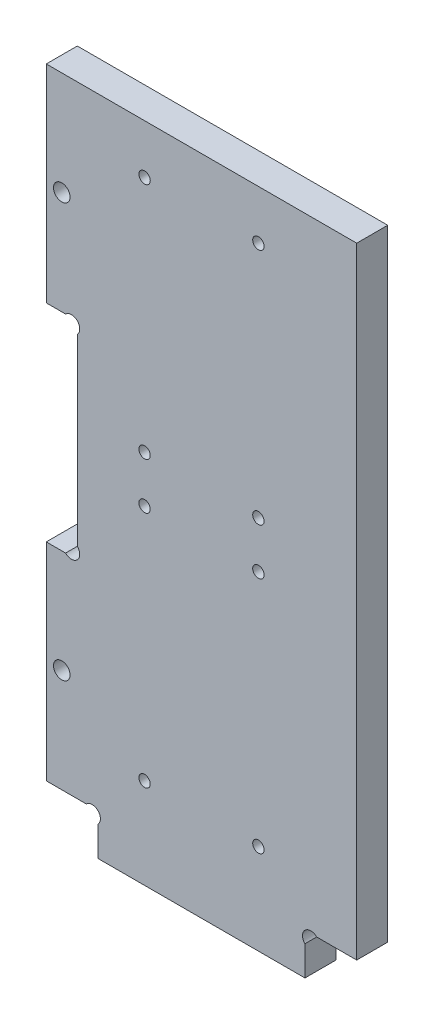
ISO-10303-21;
HEADER;
FILE_DESCRIPTION(('STEP AP214'),'2;1');
FILE_NAME('part.step','',(''),(''),'','','');
FILE_SCHEMA(('AUTOMOTIVE_DESIGN { 1 0 10303 214 1 1 1 1 }'));
ENDSEC;
DATA;
#1=APPLICATION_CONTEXT('core data for automotive mechanical design processes');
#2=APPLICATION_PROTOCOL_DEFINITION('international standard','automotive_design',2000,#1);
#3=PRODUCT_CONTEXT('',#1,'mechanical');
#4=PRODUCT('Part','Part','',(#3));
#5=PRODUCT_RELATED_PRODUCT_CATEGORY('part','',(#4));
#6=PRODUCT_DEFINITION_FORMATION('','',#4);
#7=PRODUCT_DEFINITION_CONTEXT('part definition',#1,'design');
#8=PRODUCT_DEFINITION('design','',#6,#7);
#9=PRODUCT_DEFINITION_SHAPE('','',#8);
#10=(LENGTH_UNIT() NAMED_UNIT(*) SI_UNIT(.MILLI.,.METRE.));
#11=(NAMED_UNIT(*) PLANE_ANGLE_UNIT() SI_UNIT($,.RADIAN.));
#12=(NAMED_UNIT(*) SI_UNIT($,.STERADIAN.) SOLID_ANGLE_UNIT());
#13=UNCERTAINTY_MEASURE_WITH_UNIT(LENGTH_MEASURE(1.E-05),#10,'distance_accuracy_value','');
#14=(GEOMETRIC_REPRESENTATION_CONTEXT(3) GLOBAL_UNCERTAINTY_ASSIGNED_CONTEXT((#13)) GLOBAL_UNIT_ASSIGNED_CONTEXT((#10,
#11,#12)) REPRESENTATION_CONTEXT('',''));
#15=CARTESIAN_POINT('',(0.,0.,0.));
#16=DIRECTION('',(0.,0.,1.));
#17=DIRECTION('',(1.,0.,0.));
#18=AXIS2_PLACEMENT_3D('',#15,#16,#17);
#19=CARTESIAN_POINT('',(51.1313708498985,8.86862915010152,6.));
#20=DIRECTION('',(0.,0.,-1.));
#21=DIRECTION('',(-1.,0.,0.));
#22=AXIS2_PLACEMENT_3D('',#19,#20,#21);
#23=PLANE('',#22);
#24=CARTESIAN_POINT('',(3.,110.,6.));
#25=DIRECTION('',(0.,0.,1.));
#26=DIRECTION('',(1.,0.,0.));
#27=AXIS2_PLACEMENT_3D('',#24,#25,#26);
#28=CIRCLE('',#27,1.6);
#29=CARTESIAN_POINT('',(4.6,110.,6.));
#30=VERTEX_POINT('',#29);
#31=EDGE_CURVE('E356',#30,#30,#28,.T.);
#32=ORIENTED_EDGE('',*,*,#31,.F.);
#33=EDGE_LOOP('',(#32));
#34=FACE_BOUND('',#33,.T.);
#35=CARTESIAN_POINT('',(41.,19.5,6.));
#36=DIRECTION('',(0.,0.,1.));
#37=DIRECTION('',(1.,0.,0.));
#38=AXIS2_PLACEMENT_3D('',#35,#36,#37);
#39=CIRCLE('',#38,1.1);
#40=CARTESIAN_POINT('',(42.1,19.5,6.));
#41=VERTEX_POINT('',#40);
#42=EDGE_CURVE('E368',#41,#41,#39,.T.);
#43=ORIENTED_EDGE('',*,*,#42,.F.);
#44=EDGE_LOOP('',(#43));
#45=FACE_BOUND('',#44,.T.);
#46=CARTESIAN_POINT('',(19.,65.5,6.));
#47=DIRECTION('',(0.,0.,1.));
#48=DIRECTION('',(-1.,0.,0.));
#49=AXIS2_PLACEMENT_3D('',#46,#47,#48);
#50=CIRCLE('',#49,1.1);
#51=CARTESIAN_POINT('',(17.9,65.5,6.));
#52=VERTEX_POINT('',#51);
#53=EDGE_CURVE('E380',#52,#52,#50,.T.);
#54=ORIENTED_EDGE('',*,*,#53,.F.);
#55=EDGE_LOOP('',(#54));
#56=FACE_BOUND('',#55,.T.);
#57=CARTESIAN_POINT('',(41.,74.5,6.));
#58=DIRECTION('',(0.,0.,1.));
#59=DIRECTION('',(-1.,0.,0.));
#60=AXIS2_PLACEMENT_3D('',#57,#58,#59);
#61=CIRCLE('',#60,1.09999999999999);
#62=CARTESIAN_POINT('',(39.9,74.5,6.));
#63=VERTEX_POINT('',#62);
#64=EDGE_CURVE('E392',#63,#63,#61,.T.);
#65=ORIENTED_EDGE('',*,*,#64,.F.);
#66=EDGE_LOOP('',(#65));
#67=FACE_BOUND('',#66,.T.);
#68=CARTESIAN_POINT('',(19.,120.5,6.));
#69=DIRECTION('',(0.,0.,1.));
#70=DIRECTION('',(1.,0.,0.));
#71=AXIS2_PLACEMENT_3D('',#68,#69,#70);
#72=CIRCLE('',#71,1.1);
#73=CARTESIAN_POINT('',(20.1,120.5,6.));
#74=VERTEX_POINT('',#73);
#75=EDGE_CURVE('E166',#74,#74,#72,.T.);
#76=ORIENTED_EDGE('',*,*,#75,.F.);
#77=EDGE_LOOP('',(#76));
#78=FACE_BOUND('',#77,.T.);
#79=CARTESIAN_POINT('',(51.1313708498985,8.86862915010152,6.));
#80=DIRECTION('',(0.,0.,-1.));
#81=DIRECTION('',(-1.,0.,0.));
#82=AXIS2_PLACEMENT_3D('',#79,#80,#81);
#83=CIRCLE('',#82,1.6);
#84=CARTESIAN_POINT('',(50.,7.73725830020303,6.));
#85=VERTEX_POINT('',#84);
#86=CARTESIAN_POINT('',(52.2627416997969,10.,6.));
#87=VERTEX_POINT('',#86);
#88=EDGE_CURVE('E193',#85,#87,#83,.T.);
#89=ORIENTED_EDGE('',*,*,#88,.T.);
#90=DIRECTION('',(1.,0.,0.));
#91=VECTOR('',#90,1.);
#92=CARTESIAN_POINT('',(52.2627416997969,10.,6.));
#93=LINE('',#92,#91);
#94=CARTESIAN_POINT('',(60.,10.,6.));
#95=VERTEX_POINT('',#94);
#96=EDGE_CURVE('E101',#87,#95,#93,.T.);
#97=ORIENTED_EDGE('',*,*,#96,.T.);
#98=DIRECTION('',(0.,1.,0.));
#99=VECTOR('',#98,1.);
#100=CARTESIAN_POINT('',(60.,10.,6.));
#101=LINE('',#100,#99);
#102=CARTESIAN_POINT('',(60.,130.,6.));
#103=VERTEX_POINT('',#102);
#104=EDGE_CURVE('E232',#95,#103,#101,.T.);
#105=ORIENTED_EDGE('',*,*,#104,.T.);
#106=DIRECTION('',(-1.,0.,0.));
#107=VECTOR('',#106,1.);
#108=CARTESIAN_POINT('',(0.,130.,6.));
#109=LINE('',#108,#107);
#110=CARTESIAN_POINT('',(0.,130.,6.));
#111=VERTEX_POINT('',#110);
#112=EDGE_CURVE('E251',#103,#111,#109,.T.);
#113=ORIENTED_EDGE('',*,*,#112,.T.);
#114=DIRECTION('',(0.,-1.,0.));
#115=VECTOR('',#114,1.);
#116=CARTESIAN_POINT('',(0.,90.,6.));
#117=LINE('',#116,#115);
#118=CARTESIAN_POINT('',(0.,90.,6.));
#119=VERTEX_POINT('',#118);
#120=EDGE_CURVE('E248',#111,#119,#117,.T.);
#121=ORIENTED_EDGE('',*,*,#120,.T.);
#122=DIRECTION('',(1.,0.,0.));
#123=VECTOR('',#122,1.);
#124=CARTESIAN_POINT('',(3.73725830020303,90.,6.));
#125=LINE('',#124,#123);
#126=CARTESIAN_POINT('',(3.73725830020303,90.,6.));
#127=VERTEX_POINT('',#126);
#128=EDGE_CURVE('E250',#119,#127,#125,.T.);
#129=ORIENTED_EDGE('',*,*,#128,.T.);
#130=CARTESIAN_POINT('',(4.86862915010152,88.8686291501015,6.));
#131=DIRECTION('',(0.,0.,-1.));
#132=DIRECTION('',(1.,0.,0.));
#133=AXIS2_PLACEMENT_3D('',#130,#131,#132);
#134=CIRCLE('',#133,1.59999999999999);
#135=CARTESIAN_POINT('',(6.00000000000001,87.7372583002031,6.));
#136=VERTEX_POINT('',#135);
#137=EDGE_CURVE('E253',#127,#136,#134,.T.);
#138=ORIENTED_EDGE('',*,*,#137,.T.);
#139=DIRECTION('',(0.,-1.,0.));
#140=VECTOR('',#139,1.);
#141=CARTESIAN_POINT('',(6.00000000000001,87.7372583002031,6.));
#142=LINE('',#141,#140);
#143=CARTESIAN_POINT('',(6.00000000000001,52.2627416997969,6.));
#144=VERTEX_POINT('',#143);
#145=EDGE_CURVE('E259',#136,#144,#142,.T.);
#146=ORIENTED_EDGE('',*,*,#145,.T.);
#147=CARTESIAN_POINT('',(4.86862915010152,51.1313708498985,6.));
#148=DIRECTION('',(0.,0.,-1.));
#149=DIRECTION('',(-1.,0.,0.));
#150=AXIS2_PLACEMENT_3D('',#147,#148,#149);
#151=CIRCLE('',#150,1.59999999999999);
#152=CARTESIAN_POINT('',(3.73725830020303,50.,6.));
#153=VERTEX_POINT('',#152);
#154=EDGE_CURVE('E261',#144,#153,#151,.T.);
#155=ORIENTED_EDGE('',*,*,#154,.T.);
#156=DIRECTION('',(-1.,0.,0.));
#157=VECTOR('',#156,1.);
#158=CARTESIAN_POINT('',(3.73725830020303,50.,6.));
#159=LINE('',#158,#157);
#160=CARTESIAN_POINT('',(0.,50.,6.));
#161=VERTEX_POINT('',#160);
#162=EDGE_CURVE('E263',#153,#161,#159,.T.);
#163=ORIENTED_EDGE('',*,*,#162,.T.);
#164=DIRECTION('',(0.,-1.,0.));
#165=VECTOR('',#164,1.);
#166=CARTESIAN_POINT('',(0.,10.,6.));
#167=LINE('',#166,#165);
#168=CARTESIAN_POINT('',(0.,10.,6.));
#169=VERTEX_POINT('',#168);
#170=EDGE_CURVE('E265',#161,#169,#167,.T.);
#171=ORIENTED_EDGE('',*,*,#170,.T.);
#172=DIRECTION('',(1.,0.,0.));
#173=VECTOR('',#172,1.);
#174=CARTESIAN_POINT('',(7.73725830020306,10.,6.));
#175=LINE('',#174,#173);
#176=CARTESIAN_POINT('',(7.73725830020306,10.,6.));
#177=VERTEX_POINT('',#176);
#178=EDGE_CURVE('E267',#169,#177,#175,.T.);
#179=ORIENTED_EDGE('',*,*,#178,.T.);
#180=CARTESIAN_POINT('',(8.86862915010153,8.86862915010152,6.));
#181=DIRECTION('',(0.,0.,-1.));
#182=DIRECTION('',(1.,0.,0.));
#183=AXIS2_PLACEMENT_3D('',#180,#181,#182);
#184=CIRCLE('',#183,1.6);
#185=CARTESIAN_POINT('',(10.,7.73725830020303,6.));
#186=VERTEX_POINT('',#185);
#187=EDGE_CURVE('E144',#177,#186,#184,.T.);
#188=ORIENTED_EDGE('',*,*,#187,.T.);
#189=DIRECTION('',(0.,-1.,0.));
#190=VECTOR('',#189,1.);
#191=CARTESIAN_POINT('',(10.,7.73725830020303,6.));
#192=LINE('',#191,#190);
#193=CARTESIAN_POINT('',(10.,2.,6.));
#194=VERTEX_POINT('',#193);
#195=EDGE_CURVE('E138',#186,#194,#192,.T.);
#196=ORIENTED_EDGE('',*,*,#195,.T.);
#197=DIRECTION('',(1.,0.,0.));
#198=VECTOR('',#197,1.);
#199=CARTESIAN_POINT('',(10.,2.,6.));
#200=LINE('',#199,#198);
#201=CARTESIAN_POINT('',(50.,2.,6.));
#202=VERTEX_POINT('',#201);
#203=EDGE_CURVE('E142',#194,#202,#200,.T.);
#204=ORIENTED_EDGE('',*,*,#203,.T.);
#205=DIRECTION('',(0.,1.,0.));
#206=VECTOR('',#205,1.);
#207=CARTESIAN_POINT('',(50.,7.73725830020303,6.));
#208=LINE('',#207,#206);
#209=EDGE_CURVE('E34',#202,#85,#208,.T.);
#210=ORIENTED_EDGE('',*,*,#209,.T.);
#211=EDGE_LOOP('',(#89,#97,#105,#113,#121,#129,#138,#146,#155,#163,#171,#179,#188,#196,#204,#210));
#212=FACE_BOUND('',#211,.T.);
#213=CARTESIAN_POINT('',(19.,74.5,6.));
#214=DIRECTION('',(0.,0.,1.));
#215=DIRECTION('',(1.,0.,0.));
#216=AXIS2_PLACEMENT_3D('',#213,#214,#215);
#217=CIRCLE('',#216,1.1);
#218=CARTESIAN_POINT('',(20.1,74.5,6.));
#219=VERTEX_POINT('',#218);
#220=EDGE_CURVE('E398',#219,#219,#217,.T.);
#221=ORIENTED_EDGE('',*,*,#220,.F.);
#222=EDGE_LOOP('',(#221));
#223=FACE_BOUND('',#222,.T.);
#224=CARTESIAN_POINT('',(41.,120.5,6.));
#225=DIRECTION('',(0.,0.,1.));
#226=DIRECTION('',(-1.,0.,0.));
#227=AXIS2_PLACEMENT_3D('',#224,#225,#226);
#228=CIRCLE('',#227,1.1);
#229=CARTESIAN_POINT('',(39.9,120.5,6.));
#230=VERTEX_POINT('',#229);
#231=EDGE_CURVE('E386',#230,#230,#228,.T.);
#232=ORIENTED_EDGE('',*,*,#231,.F.);
#233=EDGE_LOOP('',(#232));
#234=FACE_BOUND('',#233,.T.);
#235=CARTESIAN_POINT('',(41.,65.5,6.));
#236=DIRECTION('',(0.,0.,1.));
#237=DIRECTION('',(1.,0.,0.));
#238=AXIS2_PLACEMENT_3D('',#235,#236,#237);
#239=CIRCLE('',#238,1.09999999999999);
#240=CARTESIAN_POINT('',(42.1,65.5,6.));
#241=VERTEX_POINT('',#240);
#242=EDGE_CURVE('E374',#241,#241,#239,.T.);
#243=ORIENTED_EDGE('',*,*,#242,.F.);
#244=EDGE_LOOP('',(#243));
#245=FACE_BOUND('',#244,.T.);
#246=CARTESIAN_POINT('',(19.,19.5,6.));
#247=DIRECTION('',(0.,0.,1.));
#248=DIRECTION('',(-1.,0.,0.));
#249=AXIS2_PLACEMENT_3D('',#246,#247,#248);
#250=CIRCLE('',#249,1.1);
#251=CARTESIAN_POINT('',(17.9,19.5,6.));
#252=VERTEX_POINT('',#251);
#253=EDGE_CURVE('E362',#252,#252,#250,.T.);
#254=ORIENTED_EDGE('',*,*,#253,.F.);
#255=EDGE_LOOP('',(#254));
#256=FACE_BOUND('',#255,.T.);
#257=CARTESIAN_POINT('',(3.,30.,6.));
#258=DIRECTION('',(0.,0.,1.));
#259=DIRECTION('',(-1.,0.,0.));
#260=AXIS2_PLACEMENT_3D('',#257,#258,#259);
#261=CIRCLE('',#260,1.6);
#262=CARTESIAN_POINT('',(1.4,30.,6.));
#263=VERTEX_POINT('',#262);
#264=EDGE_CURVE('E347',#263,#263,#261,.T.);
#265=ORIENTED_EDGE('',*,*,#264,.F.);
#266=EDGE_LOOP('',(#265));
#267=FACE_BOUND('',#266,.T.);
#268=ADVANCED_FACE('F17',(#34,#45,#56,#67,#78,#212,#223,#234,#245,#256,#267),#23,.F.);
#269=CARTESIAN_POINT('',(51.1313708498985,8.86862915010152,0.));
#270=DIRECTION('',(0.,0.,-1.));
#271=DIRECTION('',(-1.,0.,0.));
#272=AXIS2_PLACEMENT_3D('',#269,#270,#271);
#273=PLANE('',#272);
#274=CARTESIAN_POINT('',(3.,110.,0.));
#275=DIRECTION('',(0.,0.,1.));
#276=DIRECTION('',(1.,0.,0.));
#277=AXIS2_PLACEMENT_3D('',#274,#275,#276);
#278=CIRCLE('',#277,1.6);
#279=CARTESIAN_POINT('',(4.6,110.,0.));
#280=VERTEX_POINT('',#279);
#281=EDGE_CURVE('E353',#280,#280,#278,.T.);
#282=ORIENTED_EDGE('',*,*,#281,.T.);
#283=EDGE_LOOP('',(#282));
#284=FACE_BOUND('',#283,.T.);
#285=CARTESIAN_POINT('',(41.,19.5,0.));
#286=DIRECTION('',(0.,0.,1.));
#287=DIRECTION('',(1.,0.,0.));
#288=AXIS2_PLACEMENT_3D('',#285,#286,#287);
#289=CIRCLE('',#288,1.1);
#290=CARTESIAN_POINT('',(42.1,19.5,0.));
#291=VERTEX_POINT('',#290);
#292=EDGE_CURVE('E365',#291,#291,#289,.T.);
#293=ORIENTED_EDGE('',*,*,#292,.T.);
#294=EDGE_LOOP('',(#293));
#295=FACE_BOUND('',#294,.T.);
#296=CARTESIAN_POINT('',(19.,65.5,0.));
#297=DIRECTION('',(0.,0.,1.));
#298=DIRECTION('',(-1.,0.,0.));
#299=AXIS2_PLACEMENT_3D('',#296,#297,#298);
#300=CIRCLE('',#299,1.1);
#301=CARTESIAN_POINT('',(17.9,65.5,0.));
#302=VERTEX_POINT('',#301);
#303=EDGE_CURVE('E377',#302,#302,#300,.T.);
#304=ORIENTED_EDGE('',*,*,#303,.T.);
#305=EDGE_LOOP('',(#304));
#306=FACE_BOUND('',#305,.T.);
#307=CARTESIAN_POINT('',(41.,74.5,0.));
#308=DIRECTION('',(0.,0.,1.));
#309=DIRECTION('',(-1.,0.,0.));
#310=AXIS2_PLACEMENT_3D('',#307,#308,#309);
#311=CIRCLE('',#310,1.09999999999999);
#312=CARTESIAN_POINT('',(39.9,74.5,0.));
#313=VERTEX_POINT('',#312);
#314=EDGE_CURVE('E389',#313,#313,#311,.T.);
#315=ORIENTED_EDGE('',*,*,#314,.T.);
#316=EDGE_LOOP('',(#315));
#317=FACE_BOUND('',#316,.T.);
#318=CARTESIAN_POINT('',(19.,120.5,0.));
#319=DIRECTION('',(0.,0.,1.));
#320=DIRECTION('',(1.,0.,0.));
#321=AXIS2_PLACEMENT_3D('',#318,#319,#320);
#322=CIRCLE('',#321,1.1);
#323=CARTESIAN_POINT('',(20.1,120.5,0.));
#324=VERTEX_POINT('',#323);
#325=EDGE_CURVE('E401',#324,#324,#322,.T.);
#326=ORIENTED_EDGE('',*,*,#325,.T.);
#327=EDGE_LOOP('',(#326));
#328=FACE_BOUND('',#327,.T.);
#329=CARTESIAN_POINT('',(51.1313708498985,8.86862915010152,0.));
#330=DIRECTION('',(0.,0.,-1.));
#331=DIRECTION('',(-1.,0.,0.));
#332=AXIS2_PLACEMENT_3D('',#329,#330,#331);
#333=CIRCLE('',#332,1.6);
#334=CARTESIAN_POINT('',(50.,7.73725830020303,0.));
#335=VERTEX_POINT('',#334);
#336=CARTESIAN_POINT('',(52.2627416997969,10.,0.));
#337=VERTEX_POINT('',#336);
#338=EDGE_CURVE('E162',#335,#337,#333,.T.);
#339=ORIENTED_EDGE('',*,*,#338,.F.);
#340=DIRECTION('',(0.,1.,0.));
#341=VECTOR('',#340,1.);
#342=CARTESIAN_POINT('',(50.,7.73725830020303,0.));
#343=LINE('',#342,#341);
#344=CARTESIAN_POINT('',(50.,2.,0.));
#345=VERTEX_POINT('',#344);
#346=EDGE_CURVE('E93',#345,#335,#343,.T.);
#347=ORIENTED_EDGE('',*,*,#346,.F.);
#348=DIRECTION('',(1.,0.,0.));
#349=VECTOR('',#348,1.);
#350=CARTESIAN_POINT('',(10.,2.,0.));
#351=LINE('',#350,#349);
#352=CARTESIAN_POINT('',(10.,2.,0.));
#353=VERTEX_POINT('',#352);
#354=EDGE_CURVE('E87',#353,#345,#351,.T.);
#355=ORIENTED_EDGE('',*,*,#354,.F.);
#356=DIRECTION('',(0.,-1.,0.));
#357=VECTOR('',#356,1.);
#358=CARTESIAN_POINT('',(10.,7.73725830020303,0.));
#359=LINE('',#358,#357);
#360=CARTESIAN_POINT('',(10.,7.73725830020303,0.));
#361=VERTEX_POINT('',#360);
#362=EDGE_CURVE('E152',#361,#353,#359,.T.);
#363=ORIENTED_EDGE('',*,*,#362,.F.);
#364=CARTESIAN_POINT('',(8.86862915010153,8.86862915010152,0.));
#365=DIRECTION('',(0.,0.,-1.));
#366=DIRECTION('',(1.,0.,0.));
#367=AXIS2_PLACEMENT_3D('',#364,#365,#366);
#368=CIRCLE('',#367,1.6);
#369=CARTESIAN_POINT('',(7.73725830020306,10.,0.));
#370=VERTEX_POINT('',#369);
#371=EDGE_CURVE('E188',#370,#361,#368,.T.);
#372=ORIENTED_EDGE('',*,*,#371,.F.);
#373=DIRECTION('',(1.,0.,0.));
#374=VECTOR('',#373,1.);
#375=CARTESIAN_POINT('',(7.73725830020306,10.,0.));
#376=LINE('',#375,#374);
#377=CARTESIAN_POINT('',(0.,10.,0.));
#378=VERTEX_POINT('',#377);
#379=EDGE_CURVE('E186',#378,#370,#376,.T.);
#380=ORIENTED_EDGE('',*,*,#379,.F.);
#381=DIRECTION('',(0.,-1.,0.));
#382=VECTOR('',#381,1.);
#383=CARTESIAN_POINT('',(0.,10.,0.));
#384=LINE('',#383,#382);
#385=CARTESIAN_POINT('',(0.,50.,0.));
#386=VERTEX_POINT('',#385);
#387=EDGE_CURVE('E184',#386,#378,#384,.T.);
#388=ORIENTED_EDGE('',*,*,#387,.F.);
#389=DIRECTION('',(-1.,0.,0.));
#390=VECTOR('',#389,1.);
#391=CARTESIAN_POINT('',(3.73725830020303,50.,0.));
#392=LINE('',#391,#390);
#393=CARTESIAN_POINT('',(3.73725830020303,50.,0.));
#394=VERTEX_POINT('',#393);
#395=EDGE_CURVE('E182',#394,#386,#392,.T.);
#396=ORIENTED_EDGE('',*,*,#395,.F.);
#397=CARTESIAN_POINT('',(4.86862915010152,51.1313708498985,0.));
#398=DIRECTION('',(0.,0.,-1.));
#399=DIRECTION('',(-1.,0.,0.));
#400=AXIS2_PLACEMENT_3D('',#397,#398,#399);
#401=CIRCLE('',#400,1.59999999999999);
#402=CARTESIAN_POINT('',(6.00000000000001,52.2627416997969,0.));
#403=VERTEX_POINT('',#402);
#404=EDGE_CURVE('E180',#403,#394,#401,.T.);
#405=ORIENTED_EDGE('',*,*,#404,.F.);
#406=DIRECTION('',(0.,-1.,0.));
#407=VECTOR('',#406,1.);
#408=CARTESIAN_POINT('',(6.00000000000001,87.7372583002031,0.));
#409=LINE('',#408,#407);
#410=CARTESIAN_POINT('',(6.00000000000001,87.7372583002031,0.));
#411=VERTEX_POINT('',#410);
#412=EDGE_CURVE('E178',#411,#403,#409,.T.);
#413=ORIENTED_EDGE('',*,*,#412,.F.);
#414=CARTESIAN_POINT('',(4.86862915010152,88.8686291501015,0.));
#415=DIRECTION('',(0.,0.,-1.));
#416=DIRECTION('',(1.,0.,0.));
#417=AXIS2_PLACEMENT_3D('',#414,#415,#416);
#418=CIRCLE('',#417,1.59999999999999);
#419=CARTESIAN_POINT('',(3.73725830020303,90.,0.));
#420=VERTEX_POINT('',#419);
#421=EDGE_CURVE('E176',#420,#411,#418,.T.);
#422=ORIENTED_EDGE('',*,*,#421,.F.);
#423=DIRECTION('',(1.,0.,0.));
#424=VECTOR('',#423,1.);
#425=CARTESIAN_POINT('',(3.73725830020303,90.,0.));
#426=LINE('',#425,#424);
#427=CARTESIAN_POINT('',(0.,90.,0.));
#428=VERTEX_POINT('',#427);
#429=EDGE_CURVE('E174',#428,#420,#426,.T.);
#430=ORIENTED_EDGE('',*,*,#429,.F.);
#431=DIRECTION('',(0.,-1.,0.));
#432=VECTOR('',#431,1.);
#433=CARTESIAN_POINT('',(0.,90.,0.));
#434=LINE('',#433,#432);
#435=CARTESIAN_POINT('',(0.,130.,0.));
#436=VERTEX_POINT('',#435);
#437=EDGE_CURVE('E172',#436,#428,#434,.T.);
#438=ORIENTED_EDGE('',*,*,#437,.F.);
#439=DIRECTION('',(-1.,0.,0.));
#440=VECTOR('',#439,1.);
#441=CARTESIAN_POINT('',(0.,130.,0.));
#442=LINE('',#441,#440);
#443=CARTESIAN_POINT('',(60.,130.,0.));
#444=VERTEX_POINT('',#443);
#445=EDGE_CURVE('E170',#444,#436,#442,.T.);
#446=ORIENTED_EDGE('',*,*,#445,.F.);
#447=DIRECTION('',(0.,1.,0.));
#448=VECTOR('',#447,1.);
#449=CARTESIAN_POINT('',(60.,10.,0.));
#450=LINE('',#449,#448);
#451=CARTESIAN_POINT('',(60.,10.,0.));
#452=VERTEX_POINT('',#451);
#453=EDGE_CURVE('E168',#452,#444,#450,.T.);
#454=ORIENTED_EDGE('',*,*,#453,.F.);
#455=DIRECTION('',(1.,0.,0.));
#456=VECTOR('',#455,1.);
#457=CARTESIAN_POINT('',(52.2627416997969,10.,0.));
#458=LINE('',#457,#456);
#459=EDGE_CURVE('E165',#337,#452,#458,.T.);
#460=ORIENTED_EDGE('',*,*,#459,.F.);
#461=EDGE_LOOP('',(#339,#347,#355,#363,#372,#380,#388,#396,#405,#413,#422,#430,#438,#446,#454,#460));
#462=FACE_BOUND('',#461,.T.);
#463=CARTESIAN_POINT('',(19.,74.5,0.));
#464=DIRECTION('',(0.,0.,1.));
#465=DIRECTION('',(1.,0.,0.));
#466=AXIS2_PLACEMENT_3D('',#463,#464,#465);
#467=CIRCLE('',#466,1.1);
#468=CARTESIAN_POINT('',(20.1,74.5,0.));
#469=VERTEX_POINT('',#468);
#470=EDGE_CURVE('E395',#469,#469,#467,.T.);
#471=ORIENTED_EDGE('',*,*,#470,.T.);
#472=EDGE_LOOP('',(#471));
#473=FACE_BOUND('',#472,.T.);
#474=CARTESIAN_POINT('',(41.,120.5,0.));
#475=DIRECTION('',(0.,0.,1.));
#476=DIRECTION('',(-1.,0.,0.));
#477=AXIS2_PLACEMENT_3D('',#474,#475,#476);
#478=CIRCLE('',#477,1.1);
#479=CARTESIAN_POINT('',(39.9,120.5,0.));
#480=VERTEX_POINT('',#479);
#481=EDGE_CURVE('E383',#480,#480,#478,.T.);
#482=ORIENTED_EDGE('',*,*,#481,.T.);
#483=EDGE_LOOP('',(#482));
#484=FACE_BOUND('',#483,.T.);
#485=CARTESIAN_POINT('',(41.,65.5,0.));
#486=DIRECTION('',(0.,0.,1.));
#487=DIRECTION('',(1.,0.,0.));
#488=AXIS2_PLACEMENT_3D('',#485,#486,#487);
#489=CIRCLE('',#488,1.09999999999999);
#490=CARTESIAN_POINT('',(42.1,65.5,0.));
#491=VERTEX_POINT('',#490);
#492=EDGE_CURVE('E371',#491,#491,#489,.T.);
#493=ORIENTED_EDGE('',*,*,#492,.T.);
#494=EDGE_LOOP('',(#493));
#495=FACE_BOUND('',#494,.T.);
#496=CARTESIAN_POINT('',(19.,19.5,0.));
#497=DIRECTION('',(0.,0.,1.));
#498=DIRECTION('',(-1.,0.,0.));
#499=AXIS2_PLACEMENT_3D('',#496,#497,#498);
#500=CIRCLE('',#499,1.1);
#501=CARTESIAN_POINT('',(17.9,19.5,0.));
#502=VERTEX_POINT('',#501);
#503=EDGE_CURVE('E359',#502,#502,#500,.T.);
#504=ORIENTED_EDGE('',*,*,#503,.T.);
#505=EDGE_LOOP('',(#504));
#506=FACE_BOUND('',#505,.T.);
#507=CARTESIAN_POINT('',(3.,30.,0.));
#508=DIRECTION('',(0.,0.,1.));
#509=DIRECTION('',(-1.,0.,0.));
#510=AXIS2_PLACEMENT_3D('',#507,#508,#509);
#511=CIRCLE('',#510,1.6);
#512=CARTESIAN_POINT('',(1.4,30.,0.));
#513=VERTEX_POINT('',#512);
#514=EDGE_CURVE('E350',#513,#513,#511,.T.);
#515=ORIENTED_EDGE('',*,*,#514,.T.);
#516=EDGE_LOOP('',(#515));
#517=FACE_BOUND('',#516,.T.);
#518=ADVANCED_FACE('F236',(#284,#295,#306,#317,#328,#462,#473,#484,#495,#506,#517),#273,.T.);
#519=CARTESIAN_POINT('',(51.1313708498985,8.86862915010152,6.));
#520=DIRECTION('',(0.,0.,-1.));
#521=DIRECTION('',(-1.,0.,0.));
#522=AXIS2_PLACEMENT_3D('',#519,#520,#521);
#523=CYLINDRICAL_SURFACE('',#522,1.6);
#524=ORIENTED_EDGE('',*,*,#338,.T.);
#525=DIRECTION('',(0.,0.,-1.));
#526=VECTOR('',#525,1.);
#527=CARTESIAN_POINT('',(52.2627416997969,10.,6.));
#528=LINE('',#527,#526);
#529=EDGE_CURVE('E11',#87,#337,#528,.T.);
#530=ORIENTED_EDGE('',*,*,#529,.F.);
#531=ORIENTED_EDGE('',*,*,#88,.F.);
#532=DIRECTION('',(0.,0.,-1.));
#533=VECTOR('',#532,1.);
#534=CARTESIAN_POINT('',(50.,7.73725830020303,6.));
#535=LINE('',#534,#533);
#536=EDGE_CURVE('E158',#85,#335,#535,.T.);
#537=ORIENTED_EDGE('',*,*,#536,.T.);
#538=EDGE_LOOP('',(#524,#530,#531,#537));
#539=FACE_BOUND('',#538,.T.);
#540=ADVANCED_FACE('F19',(#539),#523,.F.);
#541=CARTESIAN_POINT('',(52.2627416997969,10.,6.));
#542=DIRECTION('',(0.,1.,0.));
#543=DIRECTION('',(0.,0.,1.));
#544=AXIS2_PLACEMENT_3D('',#541,#542,#543);
#545=PLANE('',#544);
#546=ORIENTED_EDGE('',*,*,#459,.T.);
#547=DIRECTION('',(0.,0.,-1.));
#548=VECTOR('',#547,1.);
#549=CARTESIAN_POINT('',(60.,10.,6.));
#550=LINE('',#549,#548);
#551=EDGE_CURVE('E26',#95,#452,#550,.T.);
#552=ORIENTED_EDGE('',*,*,#551,.F.);
#553=ORIENTED_EDGE('',*,*,#96,.F.);
#554=ORIENTED_EDGE('',*,*,#529,.T.);
#555=EDGE_LOOP('',(#546,#552,#553,#554));
#556=FACE_BOUND('',#555,.T.);
#557=ADVANCED_FACE('F617',(#556),#545,.F.);
#558=CARTESIAN_POINT('',(60.,10.,6.));
#559=DIRECTION('',(-1.,0.,0.));
#560=DIRECTION('',(0.,0.,1.));
#561=AXIS2_PLACEMENT_3D('',#558,#559,#560);
#562=PLANE('',#561);
#563=ORIENTED_EDGE('',*,*,#453,.T.);
#564=DIRECTION('',(0.,0.,-1.));
#565=VECTOR('',#564,1.);
#566=CARTESIAN_POINT('',(60.,130.,6.));
#567=LINE('',#566,#565);
#568=EDGE_CURVE('E224',#103,#444,#567,.T.);
#569=ORIENTED_EDGE('',*,*,#568,.F.);
#570=ORIENTED_EDGE('',*,*,#104,.F.);
#571=ORIENTED_EDGE('',*,*,#551,.T.);
#572=EDGE_LOOP('',(#563,#569,#570,#571));
#573=FACE_BOUND('',#572,.T.);
#574=ADVANCED_FACE('F230',(#573),#562,.F.);
#575=CARTESIAN_POINT('',(0.,130.,6.));
#576=DIRECTION('',(0.,-1.,0.));
#577=DIRECTION('',(0.,0.,-1.));
#578=AXIS2_PLACEMENT_3D('',#575,#576,#577);
#579=PLANE('',#578);
#580=ORIENTED_EDGE('',*,*,#445,.T.);
#581=DIRECTION('',(0.,0.,-1.));
#582=VECTOR('',#581,1.);
#583=CARTESIAN_POINT('',(0.,130.,6.));
#584=LINE('',#583,#582);
#585=EDGE_CURVE('E221',#111,#436,#584,.T.);
#586=ORIENTED_EDGE('',*,*,#585,.F.);
#587=ORIENTED_EDGE('',*,*,#112,.F.);
#588=ORIENTED_EDGE('',*,*,#568,.T.);
#589=EDGE_LOOP('',(#580,#586,#587,#588));
#590=FACE_BOUND('',#589,.T.);
#591=ADVANCED_FACE('F242',(#590),#579,.F.);
#592=CARTESIAN_POINT('',(0.,90.,6.));
#593=DIRECTION('',(1.,0.,0.));
#594=DIRECTION('',(0.,0.,-1.));
#595=AXIS2_PLACEMENT_3D('',#592,#593,#594);
#596=PLANE('',#595);
#597=ORIENTED_EDGE('',*,*,#437,.T.);
#598=DIRECTION('',(0.,0.,-1.));
#599=VECTOR('',#598,1.);
#600=CARTESIAN_POINT('',(0.,90.,6.));
#601=LINE('',#600,#599);
#602=EDGE_CURVE('E218',#119,#428,#601,.T.);
#603=ORIENTED_EDGE('',*,*,#602,.F.);
#604=ORIENTED_EDGE('',*,*,#120,.F.);
#605=ORIENTED_EDGE('',*,*,#585,.T.);
#606=EDGE_LOOP('',(#597,#603,#604,#605));
#607=FACE_BOUND('',#606,.T.);
#608=ADVANCED_FACE('F246',(#607),#596,.F.);
#609=CARTESIAN_POINT('',(3.73725830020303,90.,6.));
#610=DIRECTION('',(0.,1.,0.));
#611=DIRECTION('',(-1.,0.,0.));
#612=AXIS2_PLACEMENT_3D('',#609,#610,#611);
#613=PLANE('',#612);
#614=ORIENTED_EDGE('',*,*,#429,.T.);
#615=DIRECTION('',(0.,0.,-1.));
#616=VECTOR('',#615,1.);
#617=CARTESIAN_POINT('',(3.73725830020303,90.,6.));
#618=LINE('',#617,#616);
#619=EDGE_CURVE('E215',#127,#420,#618,.T.);
#620=ORIENTED_EDGE('',*,*,#619,.F.);
#621=ORIENTED_EDGE('',*,*,#128,.F.);
#622=ORIENTED_EDGE('',*,*,#602,.T.);
#623=EDGE_LOOP('',(#614,#620,#621,#622));
#624=FACE_BOUND('',#623,.T.);
#625=ADVANCED_FACE('F582',(#624),#613,.F.);
#626=CARTESIAN_POINT('',(4.86862915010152,88.8686291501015,6.));
#627=DIRECTION('',(0.,0.,-1.));
#628=DIRECTION('',(-1.,0.,0.));
#629=AXIS2_PLACEMENT_3D('',#626,#627,#628);
#630=CYLINDRICAL_SURFACE('',#629,1.59999999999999);
#631=ORIENTED_EDGE('',*,*,#421,.T.);
#632=DIRECTION('',(0.,0.,-1.));
#633=VECTOR('',#632,1.);
#634=CARTESIAN_POINT('',(6.00000000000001,87.7372583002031,6.));
#635=LINE('',#634,#633);
#636=EDGE_CURVE('E212',#136,#411,#635,.T.);
#637=ORIENTED_EDGE('',*,*,#636,.F.);
#638=ORIENTED_EDGE('',*,*,#137,.F.);
#639=ORIENTED_EDGE('',*,*,#619,.T.);
#640=EDGE_LOOP('',(#631,#637,#638,#639));
#641=FACE_BOUND('',#640,.T.);
#642=ADVANCED_FACE('F572',(#641),#630,.F.);
#643=CARTESIAN_POINT('',(6.00000000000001,87.7372583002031,6.));
#644=DIRECTION('',(1.,0.,0.));
#645=DIRECTION('',(0.,0.,-1.));
#646=AXIS2_PLACEMENT_3D('',#643,#644,#645);
#647=PLANE('',#646);
#648=ORIENTED_EDGE('',*,*,#412,.T.);
#649=DIRECTION('',(0.,0.,-1.));
#650=VECTOR('',#649,1.);
#651=CARTESIAN_POINT('',(6.00000000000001,52.2627416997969,6.));
#652=LINE('',#651,#650);
#653=EDGE_CURVE('E209',#144,#403,#652,.T.);
#654=ORIENTED_EDGE('',*,*,#653,.F.);
#655=ORIENTED_EDGE('',*,*,#145,.F.);
#656=ORIENTED_EDGE('',*,*,#636,.T.);
#657=EDGE_LOOP('',(#648,#654,#655,#656));
#658=FACE_BOUND('',#657,.T.);
#659=ADVANCED_FACE('F562',(#658),#647,.F.);
#660=CARTESIAN_POINT('',(4.86862915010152,51.1313708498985,6.));
#661=DIRECTION('',(0.,0.,-1.));
#662=DIRECTION('',(-1.,0.,0.));
#663=AXIS2_PLACEMENT_3D('',#660,#661,#662);
#664=CYLINDRICAL_SURFACE('',#663,1.59999999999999);
#665=ORIENTED_EDGE('',*,*,#404,.T.);
#666=DIRECTION('',(0.,0.,-1.));
#667=VECTOR('',#666,1.);
#668=CARTESIAN_POINT('',(3.73725830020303,50.,6.));
#669=LINE('',#668,#667);
#670=EDGE_CURVE('E206',#153,#394,#669,.T.);
#671=ORIENTED_EDGE('',*,*,#670,.F.);
#672=ORIENTED_EDGE('',*,*,#154,.F.);
#673=ORIENTED_EDGE('',*,*,#653,.T.);
#674=EDGE_LOOP('',(#665,#671,#672,#673));
#675=FACE_BOUND('',#674,.T.);
#676=ADVANCED_FACE('F552',(#675),#664,.F.);
#677=CARTESIAN_POINT('',(3.73725830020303,50.,6.));
#678=DIRECTION('',(0.,-1.,0.));
#679=DIRECTION('',(1.,0.,0.));
#680=AXIS2_PLACEMENT_3D('',#677,#678,#679);
#681=PLANE('',#680);
#682=ORIENTED_EDGE('',*,*,#395,.T.);
#683=DIRECTION('',(0.,0.,-1.));
#684=VECTOR('',#683,1.);
#685=CARTESIAN_POINT('',(0.,50.,6.));
#686=LINE('',#685,#684);
#687=EDGE_CURVE('E203',#161,#386,#686,.T.);
#688=ORIENTED_EDGE('',*,*,#687,.F.);
#689=ORIENTED_EDGE('',*,*,#162,.F.);
#690=ORIENTED_EDGE('',*,*,#670,.T.);
#691=EDGE_LOOP('',(#682,#688,#689,#690));
#692=FACE_BOUND('',#691,.T.);
#693=ADVANCED_FACE('F542',(#692),#681,.F.);
#694=CARTESIAN_POINT('',(0.,10.,6.));
#695=DIRECTION('',(1.,0.,0.));
#696=DIRECTION('',(0.,0.,-1.));
#697=AXIS2_PLACEMENT_3D('',#694,#695,#696);
#698=PLANE('',#697);
#699=ORIENTED_EDGE('',*,*,#387,.T.);
#700=DIRECTION('',(0.,0.,-1.));
#701=VECTOR('',#700,1.);
#702=CARTESIAN_POINT('',(0.,10.,6.));
#703=LINE('',#702,#701);
#704=EDGE_CURVE('E200',#169,#378,#703,.T.);
#705=ORIENTED_EDGE('',*,*,#704,.F.);
#706=ORIENTED_EDGE('',*,*,#170,.F.);
#707=ORIENTED_EDGE('',*,*,#687,.T.);
#708=EDGE_LOOP('',(#699,#705,#706,#707));
#709=FACE_BOUND('',#708,.T.);
#710=ADVANCED_FACE('F533',(#709),#698,.F.);
#711=CARTESIAN_POINT('',(7.73725830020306,10.,6.));
#712=DIRECTION('',(0.,1.,0.));
#713=DIRECTION('',(-1.,0.,0.));
#714=AXIS2_PLACEMENT_3D('',#711,#712,#713);
#715=PLANE('',#714);
#716=ORIENTED_EDGE('',*,*,#379,.T.);
#717=DIRECTION('',(0.,0.,-1.));
#718=VECTOR('',#717,1.);
#719=CARTESIAN_POINT('',(7.73725830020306,10.,6.));
#720=LINE('',#719,#718);
#721=EDGE_CURVE('E197',#177,#370,#720,.T.);
#722=ORIENTED_EDGE('',*,*,#721,.F.);
#723=ORIENTED_EDGE('',*,*,#178,.F.);
#724=ORIENTED_EDGE('',*,*,#704,.T.);
#725=EDGE_LOOP('',(#716,#722,#723,#724));
#726=FACE_BOUND('',#725,.T.);
#727=ADVANCED_FACE('F273',(#726),#715,.F.);
#728=CARTESIAN_POINT('',(8.86862915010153,8.86862915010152,6.));
#729=DIRECTION('',(0.,0.,-1.));
#730=DIRECTION('',(-1.,0.,0.));
#731=AXIS2_PLACEMENT_3D('',#728,#729,#730);
#732=CYLINDRICAL_SURFACE('',#731,1.6);
#733=ORIENTED_EDGE('',*,*,#371,.T.);
#734=DIRECTION('',(0.,0.,-1.));
#735=VECTOR('',#734,1.);
#736=CARTESIAN_POINT('',(10.,7.73725830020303,6.));
#737=LINE('',#736,#735);
#738=EDGE_CURVE('E153',#186,#361,#737,.T.);
#739=ORIENTED_EDGE('',*,*,#738,.F.);
#740=ORIENTED_EDGE('',*,*,#187,.F.);
#741=ORIENTED_EDGE('',*,*,#721,.T.);
#742=EDGE_LOOP('',(#733,#739,#740,#741));
#743=FACE_BOUND('',#742,.T.);
#744=ADVANCED_FACE('F277',(#743),#732,.F.);
#745=CARTESIAN_POINT('',(10.,7.73725830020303,6.));
#746=DIRECTION('',(1.,0.,0.));
#747=DIRECTION('',(0.,1.,0.));
#748=AXIS2_PLACEMENT_3D('',#745,#746,#747);
#749=PLANE('',#748);
#750=ORIENTED_EDGE('',*,*,#362,.T.);
#751=DIRECTION('',(0.,0.,-1.));
#752=VECTOR('',#751,1.);
#753=CARTESIAN_POINT('',(10.,2.,6.));
#754=LINE('',#753,#752);
#755=EDGE_CURVE('E149',#194,#353,#754,.T.);
#756=ORIENTED_EDGE('',*,*,#755,.F.);
#757=ORIENTED_EDGE('',*,*,#195,.F.);
#758=ORIENTED_EDGE('',*,*,#738,.T.);
#759=EDGE_LOOP('',(#750,#756,#757,#758));
#760=FACE_BOUND('',#759,.T.);
#761=ADVANCED_FACE('F150',(#760),#749,.F.);
#762=CARTESIAN_POINT('',(10.,2.,6.));
#763=DIRECTION('',(0.,1.,0.));
#764=DIRECTION('',(-1.,0.,0.));
#765=AXIS2_PLACEMENT_3D('',#762,#763,#764);
#766=PLANE('',#765);
#767=ORIENTED_EDGE('',*,*,#354,.T.);
#768=DIRECTION('',(0.,0.,-1.));
#769=VECTOR('',#768,1.);
#770=CARTESIAN_POINT('',(50.,2.,6.));
#771=LINE('',#770,#769);
#772=EDGE_CURVE('E154',#202,#345,#771,.T.);
#773=ORIENTED_EDGE('',*,*,#772,.F.);
#774=ORIENTED_EDGE('',*,*,#203,.F.);
#775=ORIENTED_EDGE('',*,*,#755,.T.);
#776=EDGE_LOOP('',(#767,#773,#774,#775));
#777=FACE_BOUND('',#776,.T.);
#778=ADVANCED_FACE('F156',(#777),#766,.F.);
#779=CARTESIAN_POINT('',(50.,7.73725830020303,6.));
#780=DIRECTION('',(-1.,0.,0.));
#781=DIRECTION('',(0.,-1.,0.));
#782=AXIS2_PLACEMENT_3D('',#779,#780,#781);
#783=PLANE('',#782);
#784=ORIENTED_EDGE('',*,*,#346,.T.);
#785=ORIENTED_EDGE('',*,*,#536,.F.);
#786=ORIENTED_EDGE('',*,*,#209,.F.);
#787=ORIENTED_EDGE('',*,*,#772,.T.);
#788=EDGE_LOOP('',(#784,#785,#786,#787));
#789=FACE_BOUND('',#788,.T.);
#790=ADVANCED_FACE('F281',(#789),#783,.F.);
#791=CARTESIAN_POINT('',(19.,120.5,6.));
#792=DIRECTION('',(0.,0.,-1.));
#793=DIRECTION('',(-1.,0.,0.));
#794=AXIS2_PLACEMENT_3D('',#791,#792,#793);
#795=CYLINDRICAL_SURFACE('',#794,1.1);
#796=ORIENTED_EDGE('',*,*,#75,.T.);
#797=EDGE_LOOP('',(#796));
#798=FACE_BOUND('',#797,.T.);
#799=ORIENTED_EDGE('',*,*,#325,.F.);
#800=EDGE_LOOP('',(#799));
#801=FACE_BOUND('',#800,.T.);
#802=ADVANCED_FACE('F283',(#798,#801),#795,.F.);
#803=CARTESIAN_POINT('',(19.,74.5,6.));
#804=DIRECTION('',(0.,0.,-1.));
#805=DIRECTION('',(-1.,0.,0.));
#806=AXIS2_PLACEMENT_3D('',#803,#804,#805);
#807=CYLINDRICAL_SURFACE('',#806,1.1);
#808=ORIENTED_EDGE('',*,*,#220,.T.);
#809=EDGE_LOOP('',(#808));
#810=FACE_BOUND('',#809,.T.);
#811=ORIENTED_EDGE('',*,*,#470,.F.);
#812=EDGE_LOOP('',(#811));
#813=FACE_BOUND('',#812,.T.);
#814=ADVANCED_FACE('F291',(#810,#813),#807,.F.);
#815=CARTESIAN_POINT('',(41.,74.5,6.));
#816=DIRECTION('',(0.,0.,-1.));
#817=DIRECTION('',(-1.,0.,0.));
#818=AXIS2_PLACEMENT_3D('',#815,#816,#817);
#819=CYLINDRICAL_SURFACE('',#818,1.09999999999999);
#820=ORIENTED_EDGE('',*,*,#64,.T.);
#821=EDGE_LOOP('',(#820));
#822=FACE_BOUND('',#821,.T.);
#823=ORIENTED_EDGE('',*,*,#314,.F.);
#824=EDGE_LOOP('',(#823));
#825=FACE_BOUND('',#824,.T.);
#826=ADVANCED_FACE('F309',(#822,#825),#819,.F.);
#827=CARTESIAN_POINT('',(41.,120.5,6.));
#828=DIRECTION('',(0.,0.,-1.));
#829=DIRECTION('',(-1.,0.,0.));
#830=AXIS2_PLACEMENT_3D('',#827,#828,#829);
#831=CYLINDRICAL_SURFACE('',#830,1.1);
#832=ORIENTED_EDGE('',*,*,#231,.T.);
#833=EDGE_LOOP('',(#832));
#834=FACE_BOUND('',#833,.T.);
#835=ORIENTED_EDGE('',*,*,#481,.F.);
#836=EDGE_LOOP('',(#835));
#837=FACE_BOUND('',#836,.T.);
#838=ADVANCED_FACE('F313',(#834,#837),#831,.F.);
#839=CARTESIAN_POINT('',(19.,65.5,6.));
#840=DIRECTION('',(0.,0.,-1.));
#841=DIRECTION('',(-1.,0.,0.));
#842=AXIS2_PLACEMENT_3D('',#839,#840,#841);
#843=CYLINDRICAL_SURFACE('',#842,1.1);
#844=ORIENTED_EDGE('',*,*,#53,.T.);
#845=EDGE_LOOP('',(#844));
#846=FACE_BOUND('',#845,.T.);
#847=ORIENTED_EDGE('',*,*,#303,.F.);
#848=EDGE_LOOP('',(#847));
#849=FACE_BOUND('',#848,.T.);
#850=ADVANCED_FACE('F317',(#846,#849),#843,.F.);
#851=CARTESIAN_POINT('',(41.,65.5,6.));
#852=DIRECTION('',(0.,0.,-1.));
#853=DIRECTION('',(-1.,0.,0.));
#854=AXIS2_PLACEMENT_3D('',#851,#852,#853);
#855=CYLINDRICAL_SURFACE('',#854,1.09999999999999);
#856=ORIENTED_EDGE('',*,*,#242,.T.);
#857=EDGE_LOOP('',(#856));
#858=FACE_BOUND('',#857,.T.);
#859=ORIENTED_EDGE('',*,*,#492,.F.);
#860=EDGE_LOOP('',(#859));
#861=FACE_BOUND('',#860,.T.);
#862=ADVANCED_FACE('F321',(#858,#861),#855,.F.);
#863=CARTESIAN_POINT('',(41.,19.5,6.));
#864=DIRECTION('',(0.,0.,-1.));
#865=DIRECTION('',(-1.,0.,0.));
#866=AXIS2_PLACEMENT_3D('',#863,#864,#865);
#867=CYLINDRICAL_SURFACE('',#866,1.1);
#868=ORIENTED_EDGE('',*,*,#42,.T.);
#869=EDGE_LOOP('',(#868));
#870=FACE_BOUND('',#869,.T.);
#871=ORIENTED_EDGE('',*,*,#292,.F.);
#872=EDGE_LOOP('',(#871));
#873=FACE_BOUND('',#872,.T.);
#874=ADVANCED_FACE('F325',(#870,#873),#867,.F.);
#875=CARTESIAN_POINT('',(19.,19.5,6.));
#876=DIRECTION('',(0.,0.,-1.));
#877=DIRECTION('',(-1.,0.,0.));
#878=AXIS2_PLACEMENT_3D('',#875,#876,#877);
#879=CYLINDRICAL_SURFACE('',#878,1.1);
#880=ORIENTED_EDGE('',*,*,#253,.T.);
#881=EDGE_LOOP('',(#880));
#882=FACE_BOUND('',#881,.T.);
#883=ORIENTED_EDGE('',*,*,#503,.F.);
#884=EDGE_LOOP('',(#883));
#885=FACE_BOUND('',#884,.T.);
#886=ADVANCED_FACE('F329',(#882,#885),#879,.F.);
#887=CARTESIAN_POINT('',(3.,110.,6.));
#888=DIRECTION('',(0.,0.,-1.));
#889=DIRECTION('',(-1.,0.,0.));
#890=AXIS2_PLACEMENT_3D('',#887,#888,#889);
#891=CYLINDRICAL_SURFACE('',#890,1.6);
#892=ORIENTED_EDGE('',*,*,#31,.T.);
#893=EDGE_LOOP('',(#892));
#894=FACE_BOUND('',#893,.T.);
#895=ORIENTED_EDGE('',*,*,#281,.F.);
#896=EDGE_LOOP('',(#895));
#897=FACE_BOUND('',#896,.T.);
#898=ADVANCED_FACE('F333',(#894,#897),#891,.F.);
#899=CARTESIAN_POINT('',(3.,30.,6.));
#900=DIRECTION('',(0.,0.,-1.));
#901=DIRECTION('',(-1.,0.,0.));
#902=AXIS2_PLACEMENT_3D('',#899,#900,#901);
#903=CYLINDRICAL_SURFACE('',#902,1.6);
#904=ORIENTED_EDGE('',*,*,#264,.T.);
#905=EDGE_LOOP('',(#904));
#906=FACE_BOUND('',#905,.T.);
#907=ORIENTED_EDGE('',*,*,#514,.F.);
#908=EDGE_LOOP('',(#907));
#909=FACE_BOUND('',#908,.T.);
#910=ADVANCED_FACE('F337',(#906,#909),#903,.F.);
#911=CLOSED_SHELL('',(#268,#518,#540,#557,#574,#591,#608,#625,#642,#659,#676,#693,#710,#727,
#744,#761,#778,#790,#802,#814,#826,#838,#850,#862,#874,#886,#898,#910));
#912=MANIFOLD_SOLID_BREP('B1',#911);
#913=ADVANCED_BREP_SHAPE_REPRESENTATION('',(#18,#912),#14);
#914=SHAPE_DEFINITION_REPRESENTATION(#9,#913);
ENDSEC;
END-ISO-10303-21;
